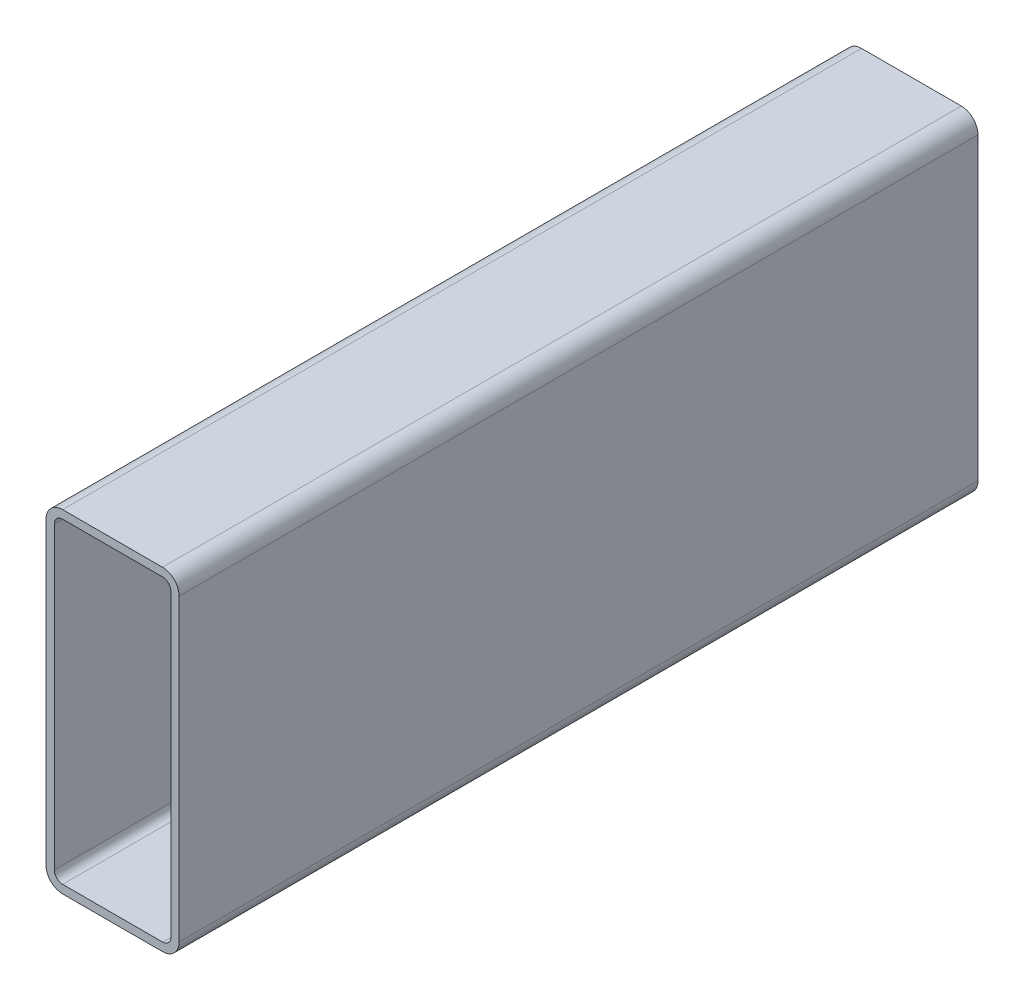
ISO-10303-21;
HEADER;
FILE_DESCRIPTION(('STEP AP214'),'2;1');
FILE_NAME('part.step','',(''),(''),'','','');
FILE_SCHEMA(('AUTOMOTIVE_DESIGN { 1 0 10303 214 1 1 1 1 }'));
ENDSEC;
DATA;
#1=APPLICATION_CONTEXT('core data for automotive mechanical design processes');
#2=APPLICATION_PROTOCOL_DEFINITION('international standard','automotive_design',2000,#1);
#3=PRODUCT_CONTEXT('',#1,'mechanical');
#4=PRODUCT('Part','Part','',(#3));
#5=PRODUCT_RELATED_PRODUCT_CATEGORY('part','',(#4));
#6=PRODUCT_DEFINITION_FORMATION('','',#4);
#7=PRODUCT_DEFINITION_CONTEXT('part definition',#1,'design');
#8=PRODUCT_DEFINITION('design','',#6,#7);
#9=PRODUCT_DEFINITION_SHAPE('','',#8);
#10=(LENGTH_UNIT() NAMED_UNIT(*) SI_UNIT(.MILLI.,.METRE.));
#11=(NAMED_UNIT(*) PLANE_ANGLE_UNIT() SI_UNIT($,.RADIAN.));
#12=(NAMED_UNIT(*) SI_UNIT($,.STERADIAN.) SOLID_ANGLE_UNIT());
#13=UNCERTAINTY_MEASURE_WITH_UNIT(LENGTH_MEASURE(1.E-05),#10,'distance_accuracy_value','');
#14=(GEOMETRIC_REPRESENTATION_CONTEXT(3) GLOBAL_UNCERTAINTY_ASSIGNED_CONTEXT((#13)) GLOBAL_UNIT_ASSIGNED_CONTEXT((#10,
#11,#12)) REPRESENTATION_CONTEXT('',''));
#15=CARTESIAN_POINT('',(0.,0.,0.));
#16=DIRECTION('',(0.,0.,1.));
#17=DIRECTION('',(1.,0.,0.));
#18=AXIS2_PLACEMENT_3D('',#15,#16,#17);
#19=CARTESIAN_POINT('',(6.35,120.65,304.8));
#20=DIRECTION('',(0.,0.,1.));
#21=DIRECTION('',(1.,0.,0.));
#22=AXIS2_PLACEMENT_3D('',#19,#20,#21);
#23=PLANE('',#22);
#24=CARTESIAN_POINT('',(6.35,120.65,304.8));
#25=DIRECTION('',(0.,0.,1.));
#26=DIRECTION('',(1.,0.,0.));
#27=AXIS2_PLACEMENT_3D('',#24,#25,#26);
#28=CIRCLE('',#27,6.35);
#29=CARTESIAN_POINT('',(6.35,127.,304.8));
#30=VERTEX_POINT('',#29);
#31=CARTESIAN_POINT('',(0.,120.65,304.8));
#32=VERTEX_POINT('',#31);
#33=EDGE_CURVE('E211',#30,#32,#28,.T.);
#34=ORIENTED_EDGE('',*,*,#33,.T.);
#35=DIRECTION('',(0.,-1.,0.));
#36=VECTOR('',#35,1.);
#37=CARTESIAN_POINT('',(0.,6.35,304.8));
#38=LINE('',#37,#36);
#39=CARTESIAN_POINT('',(0.,6.35,304.8));
#40=VERTEX_POINT('',#39);
#41=EDGE_CURVE('E214',#32,#40,#38,.T.);
#42=ORIENTED_EDGE('',*,*,#41,.T.);
#43=CARTESIAN_POINT('',(6.35,6.35,304.8));
#44=DIRECTION('',(0.,0.,1.));
#45=DIRECTION('',(1.,0.,0.));
#46=AXIS2_PLACEMENT_3D('',#43,#44,#45);
#47=CIRCLE('',#46,6.35);
#48=CARTESIAN_POINT('',(6.35,0.,304.8));
#49=VERTEX_POINT('',#48);
#50=EDGE_CURVE('E217',#40,#49,#47,.T.);
#51=ORIENTED_EDGE('',*,*,#50,.T.);
#52=DIRECTION('',(1.,0.,0.));
#53=VECTOR('',#52,1.);
#54=CARTESIAN_POINT('',(44.45,0.,304.8));
#55=LINE('',#54,#53);
#56=CARTESIAN_POINT('',(44.45,0.,304.8));
#57=VERTEX_POINT('',#56);
#58=EDGE_CURVE('E219',#49,#57,#55,.T.);
#59=ORIENTED_EDGE('',*,*,#58,.T.);
#60=CARTESIAN_POINT('',(44.45,6.35,304.8));
#61=DIRECTION('',(0.,0.,1.));
#62=DIRECTION('',(1.,0.,0.));
#63=AXIS2_PLACEMENT_3D('',#60,#61,#62);
#64=CIRCLE('',#63,6.35);
#65=CARTESIAN_POINT('',(50.8,6.35,304.8));
#66=VERTEX_POINT('',#65);
#67=EDGE_CURVE('E221',#57,#66,#64,.T.);
#68=ORIENTED_EDGE('',*,*,#67,.T.);
#69=DIRECTION('',(0.,1.,0.));
#70=VECTOR('',#69,1.);
#71=CARTESIAN_POINT('',(50.8,120.65,304.8));
#72=LINE('',#71,#70);
#73=CARTESIAN_POINT('',(50.8,120.65,304.8));
#74=VERTEX_POINT('',#73);
#75=EDGE_CURVE('E223',#66,#74,#72,.T.);
#76=ORIENTED_EDGE('',*,*,#75,.T.);
#77=CARTESIAN_POINT('',(44.45,120.65,304.8));
#78=DIRECTION('',(0.,0.,1.));
#79=DIRECTION('',(1.,0.,0.));
#80=AXIS2_PLACEMENT_3D('',#77,#78,#79);
#81=CIRCLE('',#80,6.35000000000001);
#82=CARTESIAN_POINT('',(44.45,127.,304.8));
#83=VERTEX_POINT('',#82);
#84=EDGE_CURVE('E225',#74,#83,#81,.T.);
#85=ORIENTED_EDGE('',*,*,#84,.T.);
#86=DIRECTION('',(-1.,0.,0.));
#87=VECTOR('',#86,1.);
#88=CARTESIAN_POINT('',(6.35,127.,304.8));
#89=LINE('',#88,#87);
#90=EDGE_CURVE('E227',#83,#30,#89,.T.);
#91=ORIENTED_EDGE('',*,*,#90,.T.);
#92=EDGE_LOOP('',(#34,#42,#51,#59,#68,#76,#85,#91));
#93=FACE_BOUND('',#92,.T.);
#94=DIRECTION('',(0.,-1.,0.));
#95=VECTOR('',#94,1.);
#96=CARTESIAN_POINT('',(3.175,6.35,304.8));
#97=LINE('',#96,#95);
#98=CARTESIAN_POINT('',(3.175,120.65,304.8));
#99=VERTEX_POINT('',#98);
#100=CARTESIAN_POINT('',(3.175,6.35,304.8));
#101=VERTEX_POINT('',#100);
#102=EDGE_CURVE('E154',#99,#101,#97,.T.);
#103=ORIENTED_EDGE('',*,*,#102,.F.);
#104=CARTESIAN_POINT('',(6.35,120.65,304.8));
#105=DIRECTION('',(0.,0.,1.));
#106=DIRECTION('',(1.,0.,0.));
#107=AXIS2_PLACEMENT_3D('',#104,#105,#106);
#108=CIRCLE('',#107,3.175);
#109=CARTESIAN_POINT('',(6.35,123.825,304.8));
#110=VERTEX_POINT('',#109);
#111=EDGE_CURVE('E146',#110,#99,#108,.T.);
#112=ORIENTED_EDGE('',*,*,#111,.F.);
#113=DIRECTION('',(-1.,0.,0.));
#114=VECTOR('',#113,1.);
#115=CARTESIAN_POINT('',(6.35,123.825,304.8));
#116=LINE('',#115,#114);
#117=CARTESIAN_POINT('',(44.45,123.825,304.8));
#118=VERTEX_POINT('',#117);
#119=EDGE_CURVE('E179',#118,#110,#116,.T.);
#120=ORIENTED_EDGE('',*,*,#119,.F.);
#121=CARTESIAN_POINT('',(44.45,120.65,304.8));
#122=DIRECTION('',(0.,0.,1.));
#123=DIRECTION('',(1.,0.,0.));
#124=AXIS2_PLACEMENT_3D('',#121,#122,#123);
#125=CIRCLE('',#124,3.175);
#126=CARTESIAN_POINT('',(47.625,120.65,304.8));
#127=VERTEX_POINT('',#126);
#128=EDGE_CURVE('E177',#127,#118,#125,.T.);
#129=ORIENTED_EDGE('',*,*,#128,.F.);
#130=DIRECTION('',(0.,1.,0.));
#131=VECTOR('',#130,1.);
#132=CARTESIAN_POINT('',(47.625,120.65,304.8));
#133=LINE('',#132,#131);
#134=CARTESIAN_POINT('',(47.625,6.35,304.8));
#135=VERTEX_POINT('',#134);
#136=EDGE_CURVE('E175',#135,#127,#133,.T.);
#137=ORIENTED_EDGE('',*,*,#136,.F.);
#138=CARTESIAN_POINT('',(44.45,6.35,304.8));
#139=DIRECTION('',(0.,0.,1.));
#140=DIRECTION('',(1.,0.,0.));
#141=AXIS2_PLACEMENT_3D('',#138,#139,#140);
#142=CIRCLE('',#141,3.175);
#143=CARTESIAN_POINT('',(44.45,3.175,304.8));
#144=VERTEX_POINT('',#143);
#145=EDGE_CURVE('E173',#144,#135,#142,.T.);
#146=ORIENTED_EDGE('',*,*,#145,.F.);
#147=DIRECTION('',(1.,0.,0.));
#148=VECTOR('',#147,1.);
#149=CARTESIAN_POINT('',(44.45,3.175,304.8));
#150=LINE('',#149,#148);
#151=CARTESIAN_POINT('',(6.35,3.175,304.8));
#152=VERTEX_POINT('',#151);
#153=EDGE_CURVE('E169',#152,#144,#150,.T.);
#154=ORIENTED_EDGE('',*,*,#153,.F.);
#155=CARTESIAN_POINT('',(6.35,6.35,304.8));
#156=DIRECTION('',(0.,0.,1.));
#157=DIRECTION('',(1.,0.,0.));
#158=AXIS2_PLACEMENT_3D('',#155,#156,#157);
#159=CIRCLE('',#158,3.175);
#160=EDGE_CURVE('E167',#101,#152,#159,.T.);
#161=ORIENTED_EDGE('',*,*,#160,.F.);
#162=EDGE_LOOP('',(#103,#112,#120,#129,#137,#146,#154,#161));
#163=FACE_BOUND('',#162,.T.);
#164=ADVANCED_FACE('F33',(#93,#163),#23,.T.);
#165=CARTESIAN_POINT('',(6.35,120.65,0.));
#166=DIRECTION('',(0.,0.,1.));
#167=DIRECTION('',(1.,0.,0.));
#168=AXIS2_PLACEMENT_3D('',#165,#166,#167);
#169=PLANE('',#168);
#170=CARTESIAN_POINT('',(6.35,120.65,0.));
#171=DIRECTION('',(0.,0.,1.));
#172=DIRECTION('',(1.,0.,0.));
#173=AXIS2_PLACEMENT_3D('',#170,#171,#172);
#174=CIRCLE('',#173,6.35);
#175=CARTESIAN_POINT('',(6.35,127.,0.));
#176=VERTEX_POINT('',#175);
#177=CARTESIAN_POINT('',(0.,120.65,0.));
#178=VERTEX_POINT('',#177);
#179=EDGE_CURVE('E162',#176,#178,#174,.T.);
#180=ORIENTED_EDGE('',*,*,#179,.F.);
#181=DIRECTION('',(-1.,0.,0.));
#182=VECTOR('',#181,1.);
#183=CARTESIAN_POINT('',(6.35,127.,0.));
#184=LINE('',#183,#182);
#185=CARTESIAN_POINT('',(44.45,127.,0.));
#186=VERTEX_POINT('',#185);
#187=EDGE_CURVE('E215',#186,#176,#184,.T.);
#188=ORIENTED_EDGE('',*,*,#187,.F.);
#189=CARTESIAN_POINT('',(44.45,120.65,0.));
#190=DIRECTION('',(0.,0.,1.));
#191=DIRECTION('',(1.,0.,0.));
#192=AXIS2_PLACEMENT_3D('',#189,#190,#191);
#193=CIRCLE('',#192,6.35000000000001);
#194=CARTESIAN_POINT('',(50.8,120.65,0.));
#195=VERTEX_POINT('',#194);
#196=EDGE_CURVE('E242',#195,#186,#193,.T.);
#197=ORIENTED_EDGE('',*,*,#196,.F.);
#198=DIRECTION('',(0.,1.,0.));
#199=VECTOR('',#198,1.);
#200=CARTESIAN_POINT('',(50.8,120.65,0.));
#201=LINE('',#200,#199);
#202=CARTESIAN_POINT('',(50.8,6.35,0.));
#203=VERTEX_POINT('',#202);
#204=EDGE_CURVE('E240',#203,#195,#201,.T.);
#205=ORIENTED_EDGE('',*,*,#204,.F.);
#206=CARTESIAN_POINT('',(44.45,6.35,0.));
#207=DIRECTION('',(0.,0.,1.));
#208=DIRECTION('',(1.,0.,0.));
#209=AXIS2_PLACEMENT_3D('',#206,#207,#208);
#210=CIRCLE('',#209,6.35);
#211=CARTESIAN_POINT('',(44.45,0.,0.));
#212=VERTEX_POINT('',#211);
#213=EDGE_CURVE('E238',#212,#203,#210,.T.);
#214=ORIENTED_EDGE('',*,*,#213,.F.);
#215=DIRECTION('',(1.,0.,0.));
#216=VECTOR('',#215,1.);
#217=CARTESIAN_POINT('',(44.45,0.,0.));
#218=LINE('',#217,#216);
#219=CARTESIAN_POINT('',(6.35,0.,0.));
#220=VERTEX_POINT('',#219);
#221=EDGE_CURVE('E236',#220,#212,#218,.T.);
#222=ORIENTED_EDGE('',*,*,#221,.F.);
#223=CARTESIAN_POINT('',(6.35,6.35,0.));
#224=DIRECTION('',(0.,0.,1.));
#225=DIRECTION('',(1.,0.,0.));
#226=AXIS2_PLACEMENT_3D('',#223,#224,#225);
#227=CIRCLE('',#226,6.35);
#228=CARTESIAN_POINT('',(0.,6.35,0.));
#229=VERTEX_POINT('',#228);
#230=EDGE_CURVE('E234',#229,#220,#227,.T.);
#231=ORIENTED_EDGE('',*,*,#230,.F.);
#232=DIRECTION('',(0.,-1.,0.));
#233=VECTOR('',#232,1.);
#234=CARTESIAN_POINT('',(0.,6.35,0.));
#235=LINE('',#234,#233);
#236=EDGE_CURVE('E232',#178,#229,#235,.T.);
#237=ORIENTED_EDGE('',*,*,#236,.F.);
#238=EDGE_LOOP('',(#180,#188,#197,#205,#214,#222,#231,#237));
#239=FACE_BOUND('',#238,.T.);
#240=CARTESIAN_POINT('',(6.35,120.65,0.));
#241=DIRECTION('',(0.,0.,1.));
#242=DIRECTION('',(1.,0.,0.));
#243=AXIS2_PLACEMENT_3D('',#240,#241,#242);
#244=CIRCLE('',#243,3.175);
#245=CARTESIAN_POINT('',(6.35,123.825,0.));
#246=VERTEX_POINT('',#245);
#247=CARTESIAN_POINT('',(3.175,120.65,0.));
#248=VERTEX_POINT('',#247);
#249=EDGE_CURVE('E56',#246,#248,#244,.T.);
#250=ORIENTED_EDGE('',*,*,#249,.T.);
#251=DIRECTION('',(0.,-1.,0.));
#252=VECTOR('',#251,1.);
#253=CARTESIAN_POINT('',(3.175,6.35,0.));
#254=LINE('',#253,#252);
#255=CARTESIAN_POINT('',(3.175,6.35,0.));
#256=VERTEX_POINT('',#255);
#257=EDGE_CURVE('E161',#248,#256,#254,.T.);
#258=ORIENTED_EDGE('',*,*,#257,.T.);
#259=CARTESIAN_POINT('',(6.35,6.35,0.));
#260=DIRECTION('',(0.,0.,1.));
#261=DIRECTION('',(1.,0.,0.));
#262=AXIS2_PLACEMENT_3D('',#259,#260,#261);
#263=CIRCLE('',#262,3.175);
#264=CARTESIAN_POINT('',(6.35,3.175,0.));
#265=VERTEX_POINT('',#264);
#266=EDGE_CURVE('E183',#256,#265,#263,.T.);
#267=ORIENTED_EDGE('',*,*,#266,.T.);
#268=DIRECTION('',(1.,0.,0.));
#269=VECTOR('',#268,1.);
#270=CARTESIAN_POINT('',(44.45,3.175,0.));
#271=LINE('',#270,#269);
#272=CARTESIAN_POINT('',(44.45,3.175,0.));
#273=VERTEX_POINT('',#272);
#274=EDGE_CURVE('E186',#265,#273,#271,.T.);
#275=ORIENTED_EDGE('',*,*,#274,.T.);
#276=CARTESIAN_POINT('',(44.45,6.35,0.));
#277=DIRECTION('',(0.,0.,1.));
#278=DIRECTION('',(1.,0.,0.));
#279=AXIS2_PLACEMENT_3D('',#276,#277,#278);
#280=CIRCLE('',#279,3.175);
#281=CARTESIAN_POINT('',(47.625,6.35,0.));
#282=VERTEX_POINT('',#281);
#283=EDGE_CURVE('E189',#273,#282,#280,.T.);
#284=ORIENTED_EDGE('',*,*,#283,.T.);
#285=DIRECTION('',(0.,1.,0.));
#286=VECTOR('',#285,1.);
#287=CARTESIAN_POINT('',(47.625,120.65,0.));
#288=LINE('',#287,#286);
#289=CARTESIAN_POINT('',(47.625,120.65,0.));
#290=VERTEX_POINT('',#289);
#291=EDGE_CURVE('E192',#282,#290,#288,.T.);
#292=ORIENTED_EDGE('',*,*,#291,.T.);
#293=CARTESIAN_POINT('',(44.45,120.65,0.));
#294=DIRECTION('',(0.,0.,1.));
#295=DIRECTION('',(1.,0.,0.));
#296=AXIS2_PLACEMENT_3D('',#293,#294,#295);
#297=CIRCLE('',#296,3.175);
#298=CARTESIAN_POINT('',(44.45,123.825,0.));
#299=VERTEX_POINT('',#298);
#300=EDGE_CURVE('E195',#290,#299,#297,.T.);
#301=ORIENTED_EDGE('',*,*,#300,.T.);
#302=DIRECTION('',(-1.,0.,0.));
#303=VECTOR('',#302,1.);
#304=CARTESIAN_POINT('',(6.35,123.825,0.));
#305=LINE('',#304,#303);
#306=EDGE_CURVE('E155',#299,#246,#305,.T.);
#307=ORIENTED_EDGE('',*,*,#306,.T.);
#308=EDGE_LOOP('',(#250,#258,#267,#275,#284,#292,#301,#307));
#309=FACE_BOUND('',#308,.T.);
#310=ADVANCED_FACE('F272',(#239,#309),#169,.F.);
#311=CARTESIAN_POINT('',(6.35,120.65,304.8));
#312=DIRECTION('',(0.,0.,-1.));
#313=DIRECTION('',(-1.,0.,0.));
#314=AXIS2_PLACEMENT_3D('',#311,#312,#313);
#315=CYLINDRICAL_SURFACE('',#314,6.35);
#316=ORIENTED_EDGE('',*,*,#179,.T.);
#317=DIRECTION('',(0.,0.,-1.));
#318=VECTOR('',#317,1.);
#319=CARTESIAN_POINT('',(0.,120.65,304.8));
#320=LINE('',#319,#318);
#321=EDGE_CURVE('E11',#32,#178,#320,.T.);
#322=ORIENTED_EDGE('',*,*,#321,.F.);
#323=ORIENTED_EDGE('',*,*,#33,.F.);
#324=DIRECTION('',(0.,0.,-1.));
#325=VECTOR('',#324,1.);
#326=CARTESIAN_POINT('',(6.35,127.,304.8));
#327=LINE('',#326,#325);
#328=EDGE_CURVE('E229',#30,#176,#327,.T.);
#329=ORIENTED_EDGE('',*,*,#328,.T.);
#330=EDGE_LOOP('',(#316,#322,#323,#329));
#331=FACE_BOUND('',#330,.T.);
#332=ADVANCED_FACE('F35',(#331),#315,.T.);
#333=CARTESIAN_POINT('',(0.,6.35,304.8));
#334=DIRECTION('',(1.,0.,0.));
#335=DIRECTION('',(0.,0.,-1.));
#336=AXIS2_PLACEMENT_3D('',#333,#334,#335);
#337=PLANE('',#336);
#338=ORIENTED_EDGE('',*,*,#236,.T.);
#339=DIRECTION('',(0.,0.,-1.));
#340=VECTOR('',#339,1.);
#341=CARTESIAN_POINT('',(0.,6.35,304.8));
#342=LINE('',#341,#340);
#343=EDGE_CURVE('E41',#40,#229,#342,.T.);
#344=ORIENTED_EDGE('',*,*,#343,.F.);
#345=ORIENTED_EDGE('',*,*,#41,.F.);
#346=ORIENTED_EDGE('',*,*,#321,.T.);
#347=EDGE_LOOP('',(#338,#344,#345,#346));
#348=FACE_BOUND('',#347,.T.);
#349=ADVANCED_FACE('F289',(#348),#337,.F.);
#350=CARTESIAN_POINT('',(6.35,6.35,304.8));
#351=DIRECTION('',(0.,0.,-1.));
#352=DIRECTION('',(-1.,0.,0.));
#353=AXIS2_PLACEMENT_3D('',#350,#351,#352);
#354=CYLINDRICAL_SURFACE('',#353,6.35);
#355=ORIENTED_EDGE('',*,*,#230,.T.);
#356=DIRECTION('',(0.,0.,-1.));
#357=VECTOR('',#356,1.);
#358=CARTESIAN_POINT('',(6.35,0.,304.8));
#359=LINE('',#358,#357);
#360=EDGE_CURVE('E259',#49,#220,#359,.T.);
#361=ORIENTED_EDGE('',*,*,#360,.F.);
#362=ORIENTED_EDGE('',*,*,#50,.F.);
#363=ORIENTED_EDGE('',*,*,#343,.T.);
#364=EDGE_LOOP('',(#355,#361,#362,#363));
#365=FACE_BOUND('',#364,.T.);
#366=ADVANCED_FACE('F266',(#365),#354,.T.);
#367=CARTESIAN_POINT('',(44.45,0.,304.8));
#368=DIRECTION('',(0.,1.,0.));
#369=DIRECTION('',(0.,0.,1.));
#370=AXIS2_PLACEMENT_3D('',#367,#368,#369);
#371=PLANE('',#370);
#372=ORIENTED_EDGE('',*,*,#221,.T.);
#373=DIRECTION('',(0.,0.,-1.));
#374=VECTOR('',#373,1.);
#375=CARTESIAN_POINT('',(44.45,0.,304.8));
#376=LINE('',#375,#374);
#377=EDGE_CURVE('E256',#57,#212,#376,.T.);
#378=ORIENTED_EDGE('',*,*,#377,.F.);
#379=ORIENTED_EDGE('',*,*,#58,.F.);
#380=ORIENTED_EDGE('',*,*,#360,.T.);
#381=EDGE_LOOP('',(#372,#378,#379,#380));
#382=FACE_BOUND('',#381,.T.);
#383=ADVANCED_FACE('F278',(#382),#371,.F.);
#384=CARTESIAN_POINT('',(44.45,6.35,304.8));
#385=DIRECTION('',(0.,0.,-1.));
#386=DIRECTION('',(-1.,0.,0.));
#387=AXIS2_PLACEMENT_3D('',#384,#385,#386);
#388=CYLINDRICAL_SURFACE('',#387,6.35);
#389=ORIENTED_EDGE('',*,*,#213,.T.);
#390=DIRECTION('',(0.,0.,-1.));
#391=VECTOR('',#390,1.);
#392=CARTESIAN_POINT('',(50.8,6.35,304.8));
#393=LINE('',#392,#391);
#394=EDGE_CURVE('E253',#66,#203,#393,.T.);
#395=ORIENTED_EDGE('',*,*,#394,.F.);
#396=ORIENTED_EDGE('',*,*,#67,.F.);
#397=ORIENTED_EDGE('',*,*,#377,.T.);
#398=EDGE_LOOP('',(#389,#395,#396,#397));
#399=FACE_BOUND('',#398,.T.);
#400=ADVANCED_FACE('F282',(#399),#388,.T.);
#401=CARTESIAN_POINT('',(50.8,120.65,304.8));
#402=DIRECTION('',(-1.,0.,0.));
#403=DIRECTION('',(0.,0.,1.));
#404=AXIS2_PLACEMENT_3D('',#401,#402,#403);
#405=PLANE('',#404);
#406=ORIENTED_EDGE('',*,*,#204,.T.);
#407=DIRECTION('',(0.,0.,-1.));
#408=VECTOR('',#407,1.);
#409=CARTESIAN_POINT('',(50.8,120.65,304.8));
#410=LINE('',#409,#408);
#411=EDGE_CURVE('E250',#74,#195,#410,.T.);
#412=ORIENTED_EDGE('',*,*,#411,.F.);
#413=ORIENTED_EDGE('',*,*,#75,.F.);
#414=ORIENTED_EDGE('',*,*,#394,.T.);
#415=EDGE_LOOP('',(#406,#412,#413,#414));
#416=FACE_BOUND('',#415,.T.);
#417=ADVANCED_FACE('F302',(#416),#405,.F.);
#418=CARTESIAN_POINT('',(44.45,120.65,304.8));
#419=DIRECTION('',(0.,0.,-1.));
#420=DIRECTION('',(-1.,0.,0.));
#421=AXIS2_PLACEMENT_3D('',#418,#419,#420);
#422=CYLINDRICAL_SURFACE('',#421,6.35000000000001);
#423=ORIENTED_EDGE('',*,*,#196,.T.);
#424=DIRECTION('',(0.,0.,-1.));
#425=VECTOR('',#424,1.);
#426=CARTESIAN_POINT('',(44.45,127.,304.8));
#427=LINE('',#426,#425);
#428=EDGE_CURVE('E247',#83,#186,#427,.T.);
#429=ORIENTED_EDGE('',*,*,#428,.F.);
#430=ORIENTED_EDGE('',*,*,#84,.F.);
#431=ORIENTED_EDGE('',*,*,#411,.T.);
#432=EDGE_LOOP('',(#423,#429,#430,#431));
#433=FACE_BOUND('',#432,.T.);
#434=ADVANCED_FACE('F300',(#433),#422,.T.);
#435=CARTESIAN_POINT('',(6.35,127.,304.8));
#436=DIRECTION('',(0.,-1.,0.));
#437=DIRECTION('',(0.,0.,-1.));
#438=AXIS2_PLACEMENT_3D('',#435,#436,#437);
#439=PLANE('',#438);
#440=ORIENTED_EDGE('',*,*,#187,.T.);
#441=ORIENTED_EDGE('',*,*,#328,.F.);
#442=ORIENTED_EDGE('',*,*,#90,.F.);
#443=ORIENTED_EDGE('',*,*,#428,.T.);
#444=EDGE_LOOP('',(#440,#441,#442,#443));
#445=FACE_BOUND('',#444,.T.);
#446=ADVANCED_FACE('F295',(#445),#439,.F.);
#447=CARTESIAN_POINT('',(6.35,120.65,304.8));
#448=DIRECTION('',(0.,0.,-1.));
#449=DIRECTION('',(-1.,0.,0.));
#450=AXIS2_PLACEMENT_3D('',#447,#448,#449);
#451=CYLINDRICAL_SURFACE('',#450,3.175);
#452=ORIENTED_EDGE('',*,*,#249,.F.);
#453=DIRECTION('',(0.,0.,-1.));
#454=VECTOR('',#453,1.);
#455=CARTESIAN_POINT('',(6.35,123.825,304.8));
#456=LINE('',#455,#454);
#457=EDGE_CURVE('E150',#110,#246,#456,.T.);
#458=ORIENTED_EDGE('',*,*,#457,.F.);
#459=ORIENTED_EDGE('',*,*,#111,.T.);
#460=DIRECTION('',(0.,0.,-1.));
#461=VECTOR('',#460,1.);
#462=CARTESIAN_POINT('',(3.175,120.65,304.8));
#463=LINE('',#462,#461);
#464=EDGE_CURVE('E149',#99,#248,#463,.T.);
#465=ORIENTED_EDGE('',*,*,#464,.T.);
#466=EDGE_LOOP('',(#452,#458,#459,#465));
#467=FACE_BOUND('',#466,.T.);
#468=ADVANCED_FACE('F148',(#467),#451,.F.);
#469=CARTESIAN_POINT('',(3.175,6.35,304.8));
#470=DIRECTION('',(1.,0.,0.));
#471=DIRECTION('',(0.,0.,-1.));
#472=AXIS2_PLACEMENT_3D('',#469,#470,#471);
#473=PLANE('',#472);
#474=ORIENTED_EDGE('',*,*,#257,.F.);
#475=ORIENTED_EDGE('',*,*,#464,.F.);
#476=ORIENTED_EDGE('',*,*,#102,.T.);
#477=DIRECTION('',(0.,0.,-1.));
#478=VECTOR('',#477,1.);
#479=CARTESIAN_POINT('',(3.175,6.35,304.8));
#480=LINE('',#479,#478);
#481=EDGE_CURVE('E163',#101,#256,#480,.T.);
#482=ORIENTED_EDGE('',*,*,#481,.T.);
#483=EDGE_LOOP('',(#474,#475,#476,#482));
#484=FACE_BOUND('',#483,.T.);
#485=ADVANCED_FACE('F158',(#484),#473,.T.);
#486=CARTESIAN_POINT('',(6.35,6.35,304.8));
#487=DIRECTION('',(0.,0.,-1.));
#488=DIRECTION('',(-1.,0.,0.));
#489=AXIS2_PLACEMENT_3D('',#486,#487,#488);
#490=CYLINDRICAL_SURFACE('',#489,3.175);
#491=ORIENTED_EDGE('',*,*,#266,.F.);
#492=ORIENTED_EDGE('',*,*,#481,.F.);
#493=ORIENTED_EDGE('',*,*,#160,.T.);
#494=DIRECTION('',(0.,0.,-1.));
#495=VECTOR('',#494,1.);
#496=CARTESIAN_POINT('',(6.35,3.175,304.8));
#497=LINE('',#496,#495);
#498=EDGE_CURVE('E208',#152,#265,#497,.T.);
#499=ORIENTED_EDGE('',*,*,#498,.T.);
#500=EDGE_LOOP('',(#491,#492,#493,#499));
#501=FACE_BOUND('',#500,.T.);
#502=ADVANCED_FACE('F327',(#501),#490,.F.);
#503=CARTESIAN_POINT('',(44.45,3.175,304.8));
#504=DIRECTION('',(0.,1.,0.));
#505=DIRECTION('',(0.,0.,1.));
#506=AXIS2_PLACEMENT_3D('',#503,#504,#505);
#507=PLANE('',#506);
#508=ORIENTED_EDGE('',*,*,#274,.F.);
#509=ORIENTED_EDGE('',*,*,#498,.F.);
#510=ORIENTED_EDGE('',*,*,#153,.T.);
#511=DIRECTION('',(0.,0.,-1.));
#512=VECTOR('',#511,1.);
#513=CARTESIAN_POINT('',(44.45,3.175,304.8));
#514=LINE('',#513,#512);
#515=EDGE_CURVE('E206',#144,#273,#514,.T.);
#516=ORIENTED_EDGE('',*,*,#515,.T.);
#517=EDGE_LOOP('',(#508,#509,#510,#516));
#518=FACE_BOUND('',#517,.T.);
#519=ADVANCED_FACE('F331',(#518),#507,.T.);
#520=CARTESIAN_POINT('',(44.45,6.35,304.8));
#521=DIRECTION('',(0.,0.,-1.));
#522=DIRECTION('',(-1.,0.,0.));
#523=AXIS2_PLACEMENT_3D('',#520,#521,#522);
#524=CYLINDRICAL_SURFACE('',#523,3.175);
#525=ORIENTED_EDGE('',*,*,#283,.F.);
#526=ORIENTED_EDGE('',*,*,#515,.F.);
#527=ORIENTED_EDGE('',*,*,#145,.T.);
#528=DIRECTION('',(0.,0.,-1.));
#529=VECTOR('',#528,1.);
#530=CARTESIAN_POINT('',(47.625,6.35,304.8));
#531=LINE('',#530,#529);
#532=EDGE_CURVE('E204',#135,#282,#531,.T.);
#533=ORIENTED_EDGE('',*,*,#532,.T.);
#534=EDGE_LOOP('',(#525,#526,#527,#533));
#535=FACE_BOUND('',#534,.T.);
#536=ADVANCED_FACE('F337',(#535),#524,.F.);
#537=CARTESIAN_POINT('',(47.625,120.65,304.8));
#538=DIRECTION('',(-1.,0.,0.));
#539=DIRECTION('',(0.,0.,1.));
#540=AXIS2_PLACEMENT_3D('',#537,#538,#539);
#541=PLANE('',#540);
#542=ORIENTED_EDGE('',*,*,#291,.F.);
#543=ORIENTED_EDGE('',*,*,#532,.F.);
#544=ORIENTED_EDGE('',*,*,#136,.T.);
#545=DIRECTION('',(0.,0.,-1.));
#546=VECTOR('',#545,1.);
#547=CARTESIAN_POINT('',(47.625,120.65,304.8));
#548=LINE('',#547,#546);
#549=EDGE_CURVE('E202',#127,#290,#548,.T.);
#550=ORIENTED_EDGE('',*,*,#549,.T.);
#551=EDGE_LOOP('',(#542,#543,#544,#550));
#552=FACE_BOUND('',#551,.T.);
#553=ADVANCED_FACE('F341',(#552),#541,.T.);
#554=CARTESIAN_POINT('',(44.45,120.65,304.8));
#555=DIRECTION('',(0.,0.,-1.));
#556=DIRECTION('',(-1.,0.,0.));
#557=AXIS2_PLACEMENT_3D('',#554,#555,#556);
#558=CYLINDRICAL_SURFACE('',#557,3.175);
#559=ORIENTED_EDGE('',*,*,#300,.F.);
#560=ORIENTED_EDGE('',*,*,#549,.F.);
#561=ORIENTED_EDGE('',*,*,#128,.T.);
#562=DIRECTION('',(0.,0.,-1.));
#563=VECTOR('',#562,1.);
#564=CARTESIAN_POINT('',(44.45,123.825,304.8));
#565=LINE('',#564,#563);
#566=EDGE_CURVE('E48',#118,#299,#565,.T.);
#567=ORIENTED_EDGE('',*,*,#566,.T.);
#568=EDGE_LOOP('',(#559,#560,#561,#567));
#569=FACE_BOUND('',#568,.T.);
#570=ADVANCED_FACE('F345',(#569),#558,.F.);
#571=CARTESIAN_POINT('',(6.35,123.825,304.8));
#572=DIRECTION('',(0.,-1.,0.));
#573=DIRECTION('',(0.,0.,-1.));
#574=AXIS2_PLACEMENT_3D('',#571,#572,#573);
#575=PLANE('',#574);
#576=ORIENTED_EDGE('',*,*,#306,.F.);
#577=ORIENTED_EDGE('',*,*,#566,.F.);
#578=ORIENTED_EDGE('',*,*,#119,.T.);
#579=ORIENTED_EDGE('',*,*,#457,.T.);
#580=EDGE_LOOP('',(#576,#577,#578,#579));
#581=FACE_BOUND('',#580,.T.);
#582=ADVANCED_FACE('F349',(#581),#575,.T.);
#583=CLOSED_SHELL('',(#164,#310,#332,#349,#366,#383,#400,#417,#434,#446,#468,#485,#502,#519,
#536,#553,#570,#582));
#584=MANIFOLD_SOLID_BREP('B2',#583);
#585=ADVANCED_BREP_SHAPE_REPRESENTATION('',(#18,#584),#14);
#586=SHAPE_DEFINITION_REPRESENTATION(#9,#585);
ENDSEC;
END-ISO-10303-21;
